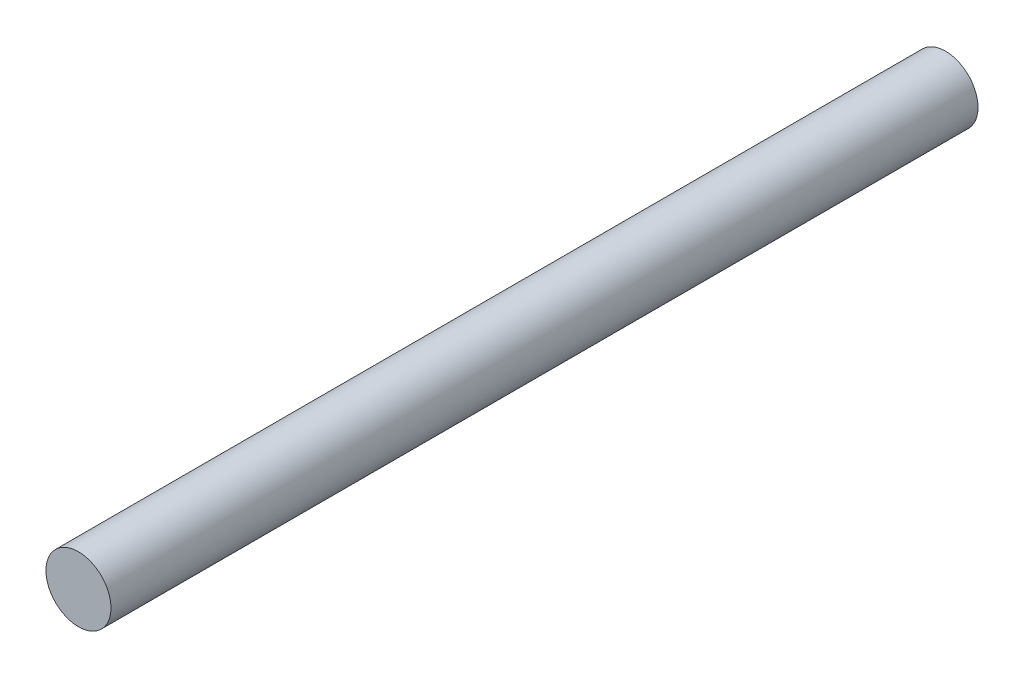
from build123d import *

# Parameters (mm, degrees)
SKETCH1_R           = 30
BOSS_EXTRUDE1_DEPTH = 800


with BuildPart() as part:
    # Sketch1 → Boss-Extrude1 (new body)
    with BuildSketch(Plane.XY):
        Circle(SKETCH1_R)
    extrude(amount=-BOSS_EXTRUDE1_DEPTH)


solid = part.part
